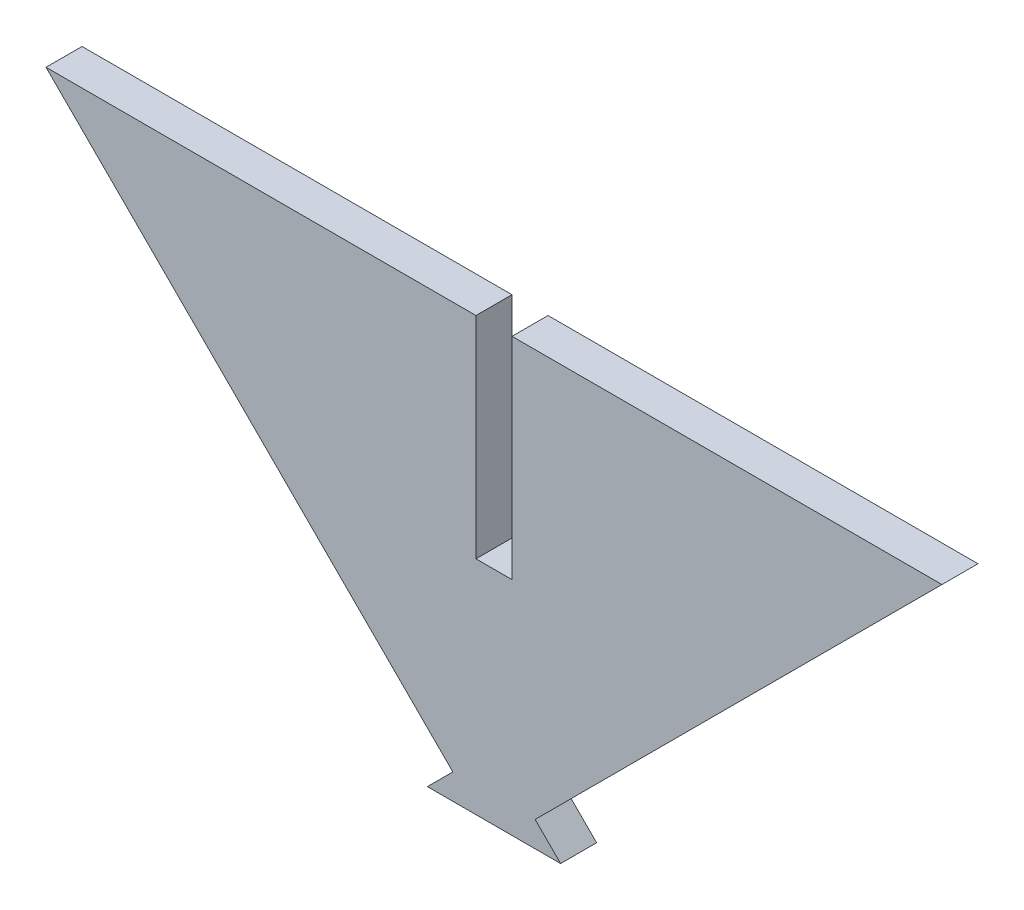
ISO-10303-21;
HEADER;
FILE_DESCRIPTION(('STEP AP214'),'2;1');
FILE_NAME('part.step','',(''),(''),'','','');
FILE_SCHEMA(('AUTOMOTIVE_DESIGN { 1 0 10303 214 1 1 1 1 }'));
ENDSEC;
DATA;
#1=APPLICATION_CONTEXT('core data for automotive mechanical design processes');
#2=APPLICATION_PROTOCOL_DEFINITION('international standard','automotive_design',2000,#1);
#3=PRODUCT_CONTEXT('',#1,'mechanical');
#4=PRODUCT('Part','Part','',(#3));
#5=PRODUCT_RELATED_PRODUCT_CATEGORY('part','',(#4));
#6=PRODUCT_DEFINITION_FORMATION('','',#4);
#7=PRODUCT_DEFINITION_CONTEXT('part definition',#1,'design');
#8=PRODUCT_DEFINITION('design','',#6,#7);
#9=PRODUCT_DEFINITION_SHAPE('','',#8);
#10=(LENGTH_UNIT() NAMED_UNIT(*) SI_UNIT(.MILLI.,.METRE.));
#11=(NAMED_UNIT(*) PLANE_ANGLE_UNIT() SI_UNIT($,.RADIAN.));
#12=(NAMED_UNIT(*) SI_UNIT($,.STERADIAN.) SOLID_ANGLE_UNIT());
#13=UNCERTAINTY_MEASURE_WITH_UNIT(LENGTH_MEASURE(1.E-05),#10,'distance_accuracy_value','');
#14=(GEOMETRIC_REPRESENTATION_CONTEXT(3) GLOBAL_UNCERTAINTY_ASSIGNED_CONTEXT((#13)) GLOBAL_UNIT_ASSIGNED_CONTEXT((#10,
#11,#12)) REPRESENTATION_CONTEXT('',''));
#15=CARTESIAN_POINT('',(0.,0.,0.));
#16=DIRECTION('',(0.,0.,1.));
#17=DIRECTION('',(1.,0.,0.));
#18=AXIS2_PLACEMENT_3D('',#15,#16,#17);
#19=CARTESIAN_POINT('',(-14.5051224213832,32.4656346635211,-12.7));
#20=DIRECTION('',(-0.707106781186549,0.707106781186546,0.));
#21=DIRECTION('',(-0.707106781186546,-0.707106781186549,0.));
#22=AXIS2_PLACEMENT_3D('',#19,#20,#21);
#23=PLANE('',#22);
#24=DIRECTION('',(-0.707106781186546,-0.707106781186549,0.));
#25=VECTOR('',#24,1.);
#26=CARTESIAN_POINT('',(-14.5051224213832,32.4656346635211,0.));
#27=LINE('',#26,#25);
#28=CARTESIAN_POINT('',(-14.5051224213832,32.4656346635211,0.));
#29=VERTEX_POINT('',#28);
#30=CARTESIAN_POINT('',(-23.4853785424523,23.4853785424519,0.));
#31=VERTEX_POINT('',#30);
#32=EDGE_CURVE('E139',#29,#31,#27,.T.);
#33=ORIENTED_EDGE('',*,*,#32,.F.);
#34=DIRECTION('',(0.,0.,1.));
#35=VECTOR('',#34,1.);
#36=CARTESIAN_POINT('',(-14.5051224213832,32.4656346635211,-12.7));
#37=LINE('',#36,#35);
#38=CARTESIAN_POINT('',(-14.5051224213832,32.4656346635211,-12.7));
#39=VERTEX_POINT('',#38);
#40=EDGE_CURVE('E11',#39,#29,#37,.T.);
#41=ORIENTED_EDGE('',*,*,#40,.F.);
#42=DIRECTION('',(-0.707106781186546,-0.707106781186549,0.));
#43=VECTOR('',#42,1.);
#44=CARTESIAN_POINT('',(-14.5051224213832,32.4656346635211,-12.7));
#45=LINE('',#44,#43);
#46=CARTESIAN_POINT('',(-23.4853785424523,23.4853785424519,-12.7));
#47=VERTEX_POINT('',#46);
#48=EDGE_CURVE('E165',#39,#47,#45,.T.);
#49=ORIENTED_EDGE('',*,*,#48,.T.);
#50=DIRECTION('',(0.,0.,1.));
#51=VECTOR('',#50,1.);
#52=CARTESIAN_POINT('',(-23.4853785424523,23.4853785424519,-12.7));
#53=LINE('',#52,#51);
#54=EDGE_CURVE('E33',#47,#31,#53,.T.);
#55=ORIENTED_EDGE('',*,*,#54,.T.);
#56=EDGE_LOOP('',(#33,#41,#49,#55));
#57=FACE_BOUND('',#56,.T.);
#58=ADVANCED_FACE('F30',(#57),#23,.T.);
#59=CARTESIAN_POINT('',(-157.924866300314,175.885378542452,-12.7));
#60=DIRECTION('',(-0.707106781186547,-0.707106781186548,0.));
#61=DIRECTION('',(0.707106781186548,-0.707106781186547,0.));
#62=AXIS2_PLACEMENT_3D('',#59,#60,#61);
#63=PLANE('',#62);
#64=DIRECTION('',(0.707106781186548,-0.707106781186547,0.));
#65=VECTOR('',#64,1.);
#66=CARTESIAN_POINT('',(-157.924866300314,175.885378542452,0.));
#67=LINE('',#66,#65);
#68=CARTESIAN_POINT('',(-157.924866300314,175.885378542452,0.));
#69=VERTEX_POINT('',#68);
#70=EDGE_CURVE('E163',#69,#29,#67,.T.);
#71=ORIENTED_EDGE('',*,*,#70,.F.);
#72=DIRECTION('',(0.,0.,1.));
#73=VECTOR('',#72,1.);
#74=CARTESIAN_POINT('',(-157.924866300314,175.885378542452,-12.7));
#75=LINE('',#74,#73);
#76=CARTESIAN_POINT('',(-157.924866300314,175.885378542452,-12.7));
#77=VERTEX_POINT('',#76);
#78=EDGE_CURVE('E39',#77,#69,#75,.T.);
#79=ORIENTED_EDGE('',*,*,#78,.F.);
#80=DIRECTION('',(0.707106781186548,-0.707106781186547,0.));
#81=VECTOR('',#80,1.);
#82=CARTESIAN_POINT('',(-157.924866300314,175.885378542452,-12.7));
#83=LINE('',#82,#81);
#84=EDGE_CURVE('E129',#77,#39,#83,.T.);
#85=ORIENTED_EDGE('',*,*,#84,.T.);
#86=ORIENTED_EDGE('',*,*,#40,.T.);
#87=EDGE_LOOP('',(#71,#79,#85,#86));
#88=FACE_BOUND('',#87,.T.);
#89=ADVANCED_FACE('F181',(#88),#63,.T.);
#90=CARTESIAN_POINT('',(-6.35,175.885378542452,-12.7));
#91=DIRECTION('',(0.,1.,0.));
#92=DIRECTION('',(-1.,0.,0.));
#93=AXIS2_PLACEMENT_3D('',#90,#91,#92);
#94=PLANE('',#93);
#95=DIRECTION('',(-1.,0.,0.));
#96=VECTOR('',#95,1.);
#97=CARTESIAN_POINT('',(-6.35,175.885378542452,0.));
#98=LINE('',#97,#96);
#99=CARTESIAN_POINT('',(-6.35,175.885378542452,0.));
#100=VERTEX_POINT('',#99);
#101=EDGE_CURVE('E116',#100,#69,#98,.T.);
#102=ORIENTED_EDGE('',*,*,#101,.F.);
#103=DIRECTION('',(0.,0.,1.));
#104=VECTOR('',#103,1.);
#105=CARTESIAN_POINT('',(-6.35,175.885378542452,-12.7));
#106=LINE('',#105,#104);
#107=CARTESIAN_POINT('',(-6.35,175.885378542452,-12.7));
#108=VERTEX_POINT('',#107);
#109=EDGE_CURVE('E111',#108,#100,#106,.T.);
#110=ORIENTED_EDGE('',*,*,#109,.F.);
#111=DIRECTION('',(-1.,0.,0.));
#112=VECTOR('',#111,1.);
#113=CARTESIAN_POINT('',(-6.35,175.885378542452,-12.7));
#114=LINE('',#113,#112);
#115=EDGE_CURVE('E114',#108,#77,#114,.T.);
#116=ORIENTED_EDGE('',*,*,#115,.T.);
#117=ORIENTED_EDGE('',*,*,#78,.T.);
#118=EDGE_LOOP('',(#102,#110,#116,#117));
#119=FACE_BOUND('',#118,.T.);
#120=ADVANCED_FACE('F113',(#119),#94,.T.);
#121=CARTESIAN_POINT('',(-6.35,175.885378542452,-12.7));
#122=DIRECTION('',(1.,0.,0.));
#123=DIRECTION('',(0.,0.,-1.));
#124=AXIS2_PLACEMENT_3D('',#121,#122,#123);
#125=PLANE('',#124);
#126=DIRECTION('',(0.,1.,0.));
#127=VECTOR('',#126,1.);
#128=CARTESIAN_POINT('',(-6.35,175.885378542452,0.));
#129=LINE('',#128,#127);
#130=CARTESIAN_POINT('',(-6.35,101.6,0.));
#131=VERTEX_POINT('',#130);
#132=EDGE_CURVE('E160',#131,#100,#129,.T.);
#133=ORIENTED_EDGE('',*,*,#132,.F.);
#134=DIRECTION('',(0.,0.,1.));
#135=VECTOR('',#134,1.);
#136=CARTESIAN_POINT('',(-6.35,101.6,-12.7));
#137=LINE('',#136,#135);
#138=CARTESIAN_POINT('',(-6.35,101.6,-12.7));
#139=VERTEX_POINT('',#138);
#140=EDGE_CURVE('E121',#139,#131,#137,.T.);
#141=ORIENTED_EDGE('',*,*,#140,.F.);
#142=DIRECTION('',(0.,1.,0.));
#143=VECTOR('',#142,1.);
#144=CARTESIAN_POINT('',(-6.35,175.885378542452,-12.7));
#145=LINE('',#144,#143);
#146=EDGE_CURVE('E127',#139,#108,#145,.T.);
#147=ORIENTED_EDGE('',*,*,#146,.T.);
#148=ORIENTED_EDGE('',*,*,#109,.T.);
#149=EDGE_LOOP('',(#133,#141,#147,#148));
#150=FACE_BOUND('',#149,.T.);
#151=ADVANCED_FACE('F131',(#150),#125,.T.);
#152=CARTESIAN_POINT('',(6.35,101.6,-12.7));
#153=DIRECTION('',(0.,1.,0.));
#154=DIRECTION('',(0.,0.,1.));
#155=AXIS2_PLACEMENT_3D('',#152,#153,#154);
#156=PLANE('',#155);
#157=DIRECTION('',(-1.,0.,0.));
#158=VECTOR('',#157,1.);
#159=CARTESIAN_POINT('',(6.35,101.6,0.));
#160=LINE('',#159,#158);
#161=CARTESIAN_POINT('',(6.35,101.6,0.));
#162=VERTEX_POINT('',#161);
#163=EDGE_CURVE('E157',#162,#131,#160,.T.);
#164=ORIENTED_EDGE('',*,*,#163,.F.);
#165=DIRECTION('',(0.,0.,1.));
#166=VECTOR('',#165,1.);
#167=CARTESIAN_POINT('',(6.35,101.6,-12.7));
#168=LINE('',#167,#166);
#169=CARTESIAN_POINT('',(6.35,101.6,-12.7));
#170=VERTEX_POINT('',#169);
#171=EDGE_CURVE('E169',#170,#162,#168,.T.);
#172=ORIENTED_EDGE('',*,*,#171,.F.);
#173=DIRECTION('',(-1.,0.,0.));
#174=VECTOR('',#173,1.);
#175=CARTESIAN_POINT('',(6.35,101.6,-12.7));
#176=LINE('',#175,#174);
#177=EDGE_CURVE('E132',#170,#139,#176,.T.);
#178=ORIENTED_EDGE('',*,*,#177,.T.);
#179=ORIENTED_EDGE('',*,*,#140,.T.);
#180=EDGE_LOOP('',(#164,#172,#178,#179));
#181=FACE_BOUND('',#180,.T.);
#182=ADVANCED_FACE('F194',(#181),#156,.T.);
#183=CARTESIAN_POINT('',(6.35,175.885378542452,-12.7));
#184=DIRECTION('',(-1.,0.,0.));
#185=DIRECTION('',(0.,0.,1.));
#186=AXIS2_PLACEMENT_3D('',#183,#184,#185);
#187=PLANE('',#186);
#188=DIRECTION('',(0.,-1.,0.));
#189=VECTOR('',#188,1.);
#190=CARTESIAN_POINT('',(6.35,175.885378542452,0.));
#191=LINE('',#190,#189);
#192=CARTESIAN_POINT('',(6.35,175.885378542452,0.));
#193=VERTEX_POINT('',#192);
#194=EDGE_CURVE('E154',#193,#162,#191,.T.);
#195=ORIENTED_EDGE('',*,*,#194,.F.);
#196=DIRECTION('',(0.,0.,1.));
#197=VECTOR('',#196,1.);
#198=CARTESIAN_POINT('',(6.35,175.885378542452,-12.7));
#199=LINE('',#198,#197);
#200=CARTESIAN_POINT('',(6.35,175.885378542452,-12.7));
#201=VERTEX_POINT('',#200);
#202=EDGE_CURVE('E171',#201,#193,#199,.T.);
#203=ORIENTED_EDGE('',*,*,#202,.F.);
#204=DIRECTION('',(0.,-1.,0.));
#205=VECTOR('',#204,1.);
#206=CARTESIAN_POINT('',(6.35,175.885378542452,-12.7));
#207=LINE('',#206,#205);
#208=EDGE_CURVE('E134',#201,#170,#207,.T.);
#209=ORIENTED_EDGE('',*,*,#208,.T.);
#210=ORIENTED_EDGE('',*,*,#171,.T.);
#211=EDGE_LOOP('',(#195,#203,#209,#210));
#212=FACE_BOUND('',#211,.T.);
#213=ADVANCED_FACE('F197',(#212),#187,.T.);
#214=CARTESIAN_POINT('',(157.924866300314,175.885378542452,-12.7));
#215=DIRECTION('',(0.,1.,0.));
#216=DIRECTION('',(-1.,0.,0.));
#217=AXIS2_PLACEMENT_3D('',#214,#215,#216);
#218=PLANE('',#217);
#219=DIRECTION('',(-1.,0.,0.));
#220=VECTOR('',#219,1.);
#221=CARTESIAN_POINT('',(157.924866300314,175.885378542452,0.));
#222=LINE('',#221,#220);
#223=CARTESIAN_POINT('',(157.924866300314,175.885378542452,0.));
#224=VERTEX_POINT('',#223);
#225=EDGE_CURVE('E151',#224,#193,#222,.T.);
#226=ORIENTED_EDGE('',*,*,#225,.F.);
#227=DIRECTION('',(0.,0.,1.));
#228=VECTOR('',#227,1.);
#229=CARTESIAN_POINT('',(157.924866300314,175.885378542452,-12.7));
#230=LINE('',#229,#228);
#231=CARTESIAN_POINT('',(157.924866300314,175.885378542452,-12.7));
#232=VERTEX_POINT('',#231);
#233=EDGE_CURVE('E173',#232,#224,#230,.T.);
#234=ORIENTED_EDGE('',*,*,#233,.F.);
#235=DIRECTION('',(-1.,0.,0.));
#236=VECTOR('',#235,1.);
#237=CARTESIAN_POINT('',(157.924866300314,175.885378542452,-12.7));
#238=LINE('',#237,#236);
#239=EDGE_CURVE('E296',#232,#201,#238,.T.);
#240=ORIENTED_EDGE('',*,*,#239,.T.);
#241=ORIENTED_EDGE('',*,*,#202,.T.);
#242=EDGE_LOOP('',(#226,#234,#240,#241));
#243=FACE_BOUND('',#242,.T.);
#244=ADVANCED_FACE('F201',(#243),#218,.T.);
#245=CARTESIAN_POINT('',(157.924866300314,175.885378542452,-12.7));
#246=DIRECTION('',(0.707106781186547,-0.707106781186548,0.));
#247=DIRECTION('',(0.707106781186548,0.707106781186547,0.));
#248=AXIS2_PLACEMENT_3D('',#245,#246,#247);
#249=PLANE('',#248);
#250=DIRECTION('',(0.707106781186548,0.707106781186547,0.));
#251=VECTOR('',#250,1.);
#252=CARTESIAN_POINT('',(157.924866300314,175.885378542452,0.));
#253=LINE('',#252,#251);
#254=CARTESIAN_POINT('',(14.5051224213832,32.4656346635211,0.));
#255=VERTEX_POINT('',#254);
#256=EDGE_CURVE('E148',#255,#224,#253,.T.);
#257=ORIENTED_EDGE('',*,*,#256,.F.);
#258=DIRECTION('',(0.,0.,1.));
#259=VECTOR('',#258,1.);
#260=CARTESIAN_POINT('',(14.5051224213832,32.4656346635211,-12.7));
#261=LINE('',#260,#259);
#262=CARTESIAN_POINT('',(14.5051224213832,32.4656346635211,-12.7));
#263=VERTEX_POINT('',#262);
#264=EDGE_CURVE('E175',#263,#255,#261,.T.);
#265=ORIENTED_EDGE('',*,*,#264,.F.);
#266=DIRECTION('',(0.707106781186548,0.707106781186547,0.));
#267=VECTOR('',#266,1.);
#268=CARTESIAN_POINT('',(157.924866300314,175.885378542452,-12.7));
#269=LINE('',#268,#267);
#270=EDGE_CURVE('E292',#263,#232,#269,.T.);
#271=ORIENTED_EDGE('',*,*,#270,.T.);
#272=ORIENTED_EDGE('',*,*,#233,.T.);
#273=EDGE_LOOP('',(#257,#265,#271,#272));
#274=FACE_BOUND('',#273,.T.);
#275=ADVANCED_FACE('F205',(#274),#249,.T.);
#276=CARTESIAN_POINT('',(23.4853785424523,23.4853785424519,-12.7));
#277=DIRECTION('',(0.707106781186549,0.707106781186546,0.));
#278=DIRECTION('',(-0.707106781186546,0.707106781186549,0.));
#279=AXIS2_PLACEMENT_3D('',#276,#277,#278);
#280=PLANE('',#279);
#281=DIRECTION('',(-0.707106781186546,0.707106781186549,0.));
#282=VECTOR('',#281,1.);
#283=CARTESIAN_POINT('',(23.4853785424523,23.4853785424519,0.));
#284=LINE('',#283,#282);
#285=CARTESIAN_POINT('',(23.4853785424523,23.4853785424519,0.));
#286=VERTEX_POINT('',#285);
#287=EDGE_CURVE('E145',#286,#255,#284,.T.);
#288=ORIENTED_EDGE('',*,*,#287,.F.);
#289=DIRECTION('',(0.,0.,1.));
#290=VECTOR('',#289,1.);
#291=CARTESIAN_POINT('',(23.4853785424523,23.4853785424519,-12.7));
#292=LINE('',#291,#290);
#293=CARTESIAN_POINT('',(23.4853785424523,23.4853785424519,-12.7));
#294=VERTEX_POINT('',#293);
#295=EDGE_CURVE('E176',#294,#286,#292,.T.);
#296=ORIENTED_EDGE('',*,*,#295,.F.);
#297=DIRECTION('',(-0.707106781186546,0.707106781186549,0.));
#298=VECTOR('',#297,1.);
#299=CARTESIAN_POINT('',(23.4853785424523,23.4853785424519,-12.7));
#300=LINE('',#299,#298);
#301=EDGE_CURVE('E303',#294,#263,#300,.T.);
#302=ORIENTED_EDGE('',*,*,#301,.T.);
#303=ORIENTED_EDGE('',*,*,#264,.T.);
#304=EDGE_LOOP('',(#288,#296,#302,#303));
#305=FACE_BOUND('',#304,.T.);
#306=ADVANCED_FACE('F209',(#305),#280,.T.);
#307=CARTESIAN_POINT('',(23.4853785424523,23.4853785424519,-12.7));
#308=DIRECTION('',(0.,-1.,0.));
#309=DIRECTION('',(1.,0.,0.));
#310=AXIS2_PLACEMENT_3D('',#307,#308,#309);
#311=PLANE('',#310);
#312=DIRECTION('',(1.,0.,0.));
#313=VECTOR('',#312,1.);
#314=CARTESIAN_POINT('',(23.4853785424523,23.4853785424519,0.));
#315=LINE('',#314,#313);
#316=EDGE_CURVE('E142',#31,#286,#315,.T.);
#317=ORIENTED_EDGE('',*,*,#316,.F.);
#318=ORIENTED_EDGE('',*,*,#54,.F.);
#319=DIRECTION('',(1.,0.,0.));
#320=VECTOR('',#319,1.);
#321=CARTESIAN_POINT('',(23.4853785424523,23.4853785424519,-12.7));
#322=LINE('',#321,#320);
#323=EDGE_CURVE('E305',#47,#294,#322,.T.);
#324=ORIENTED_EDGE('',*,*,#323,.T.);
#325=ORIENTED_EDGE('',*,*,#295,.T.);
#326=EDGE_LOOP('',(#317,#318,#324,#325));
#327=FACE_BOUND('',#326,.T.);
#328=ADVANCED_FACE('F178',(#327),#311,.T.);
#329=CARTESIAN_POINT('',(-14.5051224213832,32.4656346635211,-12.7));
#330=DIRECTION('',(0.,0.,1.));
#331=DIRECTION('',(1.,0.,0.));
#332=AXIS2_PLACEMENT_3D('',#329,#330,#331);
#333=PLANE('',#332);
#334=ORIENTED_EDGE('',*,*,#48,.F.);
#335=ORIENTED_EDGE('',*,*,#84,.F.);
#336=ORIENTED_EDGE('',*,*,#115,.F.);
#337=ORIENTED_EDGE('',*,*,#146,.F.);
#338=ORIENTED_EDGE('',*,*,#177,.F.);
#339=ORIENTED_EDGE('',*,*,#208,.F.);
#340=ORIENTED_EDGE('',*,*,#239,.F.);
#341=ORIENTED_EDGE('',*,*,#270,.F.);
#342=ORIENTED_EDGE('',*,*,#301,.F.);
#343=ORIENTED_EDGE('',*,*,#323,.F.);
#344=EDGE_LOOP('',(#334,#335,#336,#337,#338,#339,#340,#341,#342,#343));
#345=FACE_BOUND('',#344,.T.);
#346=ADVANCED_FACE('F125',(#345),#333,.F.);
#347=CARTESIAN_POINT('',(-14.5051224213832,32.4656346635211,0.));
#348=DIRECTION('',(0.,0.,1.));
#349=DIRECTION('',(1.,0.,0.));
#350=AXIS2_PLACEMENT_3D('',#347,#348,#349);
#351=PLANE('',#350);
#352=ORIENTED_EDGE('',*,*,#32,.T.);
#353=ORIENTED_EDGE('',*,*,#316,.T.);
#354=ORIENTED_EDGE('',*,*,#287,.T.);
#355=ORIENTED_EDGE('',*,*,#256,.T.);
#356=ORIENTED_EDGE('',*,*,#225,.T.);
#357=ORIENTED_EDGE('',*,*,#194,.T.);
#358=ORIENTED_EDGE('',*,*,#163,.T.);
#359=ORIENTED_EDGE('',*,*,#132,.T.);
#360=ORIENTED_EDGE('',*,*,#101,.T.);
#361=ORIENTED_EDGE('',*,*,#70,.T.);
#362=EDGE_LOOP('',(#352,#353,#354,#355,#356,#357,#358,#359,#360,#361));
#363=FACE_BOUND('',#362,.T.);
#364=ADVANCED_FACE('F180',(#363),#351,.T.);
#365=CLOSED_SHELL('',(#58,#89,#120,#151,#182,#213,#244,#275,#306,#328,#346,#364));
#366=MANIFOLD_SOLID_BREP('B2',#365);
#367=ADVANCED_BREP_SHAPE_REPRESENTATION('',(#18,#366),#14);
#368=SHAPE_DEFINITION_REPRESENTATION(#9,#367);
ENDSEC;
END-ISO-10303-21;
